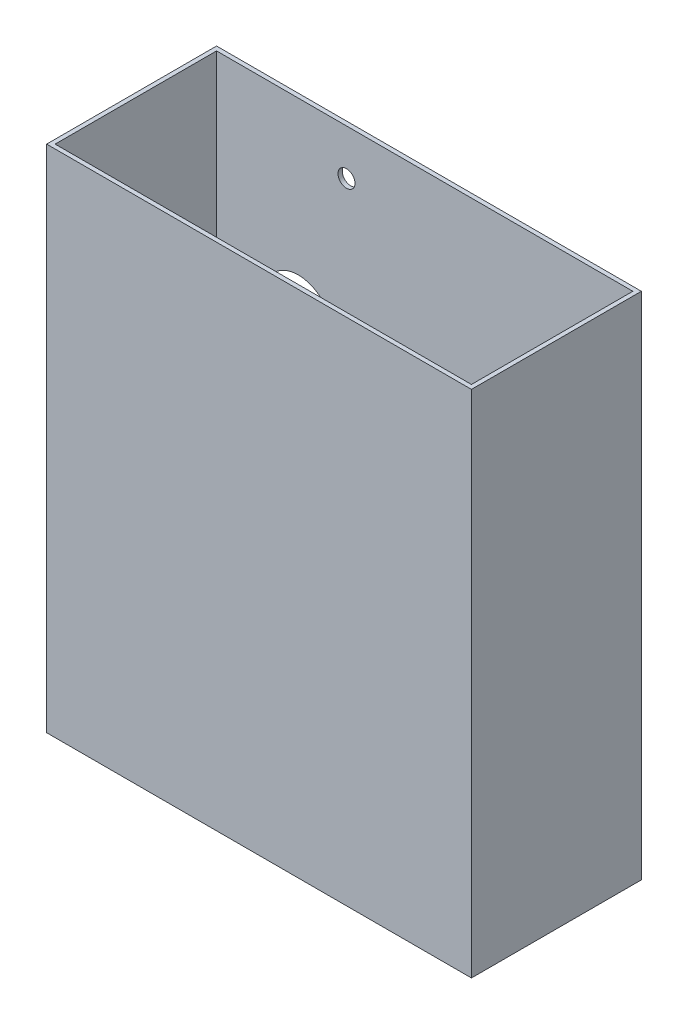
ISO-10303-21;
HEADER;
FILE_DESCRIPTION(('STEP AP214'),'2;1');
FILE_NAME('part.step','',(''),(''),'','','');
FILE_SCHEMA(('AUTOMOTIVE_DESIGN { 1 0 10303 214 1 1 1 1 }'));
ENDSEC;
DATA;
#1=APPLICATION_CONTEXT('core data for automotive mechanical design processes');
#2=APPLICATION_PROTOCOL_DEFINITION('international standard','automotive_design',2000,#1);
#3=PRODUCT_CONTEXT('',#1,'mechanical');
#4=PRODUCT('Part','Part','',(#3));
#5=PRODUCT_RELATED_PRODUCT_CATEGORY('part','',(#4));
#6=PRODUCT_DEFINITION_FORMATION('','',#4);
#7=PRODUCT_DEFINITION_CONTEXT('part definition',#1,'design');
#8=PRODUCT_DEFINITION('design','',#6,#7);
#9=PRODUCT_DEFINITION_SHAPE('','',#8);
#10=(LENGTH_UNIT() NAMED_UNIT(*) SI_UNIT(.MILLI.,.METRE.));
#11=(NAMED_UNIT(*) PLANE_ANGLE_UNIT() SI_UNIT($,.RADIAN.));
#12=(NAMED_UNIT(*) SI_UNIT($,.STERADIAN.) SOLID_ANGLE_UNIT());
#13=UNCERTAINTY_MEASURE_WITH_UNIT(LENGTH_MEASURE(1.E-05),#10,'distance_accuracy_value','');
#14=(GEOMETRIC_REPRESENTATION_CONTEXT(3) GLOBAL_UNCERTAINTY_ASSIGNED_CONTEXT((#13)) GLOBAL_UNIT_ASSIGNED_CONTEXT((#10,
#11,#12)) REPRESENTATION_CONTEXT('',''));
#15=CARTESIAN_POINT('',(0.,0.,0.));
#16=DIRECTION('',(0.,0.,1.));
#17=DIRECTION('',(1.,0.,0.));
#18=AXIS2_PLACEMENT_3D('',#15,#16,#17);
#19=CARTESIAN_POINT('',(63.5,152.4,-25.4));
#20=DIRECTION('',(-1.,0.,0.));
#21=DIRECTION('',(0.,0.,1.));
#22=AXIS2_PLACEMENT_3D('',#19,#20,#21);
#23=PLANE('',#22);
#24=DIRECTION('',(0.,0.,-1.));
#25=VECTOR('',#24,1.);
#26=CARTESIAN_POINT('',(63.5,0.,-25.4));
#27=LINE('',#26,#25);
#28=CARTESIAN_POINT('',(63.5,0.,25.4));
#29=VERTEX_POINT('',#28);
#30=CARTESIAN_POINT('',(63.5,0.,-25.4));
#31=VERTEX_POINT('',#30);
#32=EDGE_CURVE('E167',#29,#31,#27,.T.);
#33=ORIENTED_EDGE('',*,*,#32,.T.);
#34=DIRECTION('',(0.,-1.,0.));
#35=VECTOR('',#34,1.);
#36=CARTESIAN_POINT('',(63.5,152.4,-25.4));
#37=LINE('',#36,#35);
#38=CARTESIAN_POINT('',(63.5,152.4,-25.4));
#39=VERTEX_POINT('',#38);
#40=EDGE_CURVE('E11',#39,#31,#37,.T.);
#41=ORIENTED_EDGE('',*,*,#40,.F.);
#42=DIRECTION('',(0.,0.,-1.));
#43=VECTOR('',#42,1.);
#44=CARTESIAN_POINT('',(63.5,152.4,-25.4));
#45=LINE('',#44,#43);
#46=CARTESIAN_POINT('',(63.5,152.4,25.4));
#47=VERTEX_POINT('',#46);
#48=EDGE_CURVE('E173',#47,#39,#45,.T.);
#49=ORIENTED_EDGE('',*,*,#48,.F.);
#50=DIRECTION('',(0.,-1.,0.));
#51=VECTOR('',#50,1.);
#52=CARTESIAN_POINT('',(63.5,152.4,25.4));
#53=LINE('',#52,#51);
#54=EDGE_CURVE('E183',#47,#29,#53,.T.);
#55=ORIENTED_EDGE('',*,*,#54,.T.);
#56=EDGE_LOOP('',(#33,#41,#49,#55));
#57=FACE_BOUND('',#56,.T.);
#58=ADVANCED_FACE('F43',(#57),#23,.F.);
#59=CARTESIAN_POINT('',(-63.5,152.4,-25.4));
#60=DIRECTION('',(0.,0.,1.));
#61=DIRECTION('',(1.,0.,0.));
#62=AXIS2_PLACEMENT_3D('',#59,#60,#61);
#63=PLANE('',#62);
#64=CARTESIAN_POINT('',(-23.3777680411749,138.793670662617,-25.4));
#65=DIRECTION('',(0.,0.,-1.));
#66=DIRECTION('',(-1.,0.,0.));
#67=AXIS2_PLACEMENT_3D('',#64,#65,#66);
#68=CIRCLE('',#67,2.54);
#69=CARTESIAN_POINT('',(-25.9177680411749,138.793670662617,-25.4));
#70=VERTEX_POINT('',#69);
#71=EDGE_CURVE('E414',#70,#70,#68,.T.);
#72=ORIENTED_EDGE('',*,*,#71,.F.);
#73=EDGE_LOOP('',(#72));
#74=FACE_BOUND('',#73,.T.);
#75=CARTESIAN_POINT('',(-37.7685637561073,20.3620376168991,-25.4));
#76=DIRECTION('',(0.,0.,-1.));
#77=DIRECTION('',(-1.,0.,0.));
#78=AXIS2_PLACEMENT_3D('',#75,#76,#77);
#79=CIRCLE('',#78,11.176);
#80=CARTESIAN_POINT('',(-48.9445637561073,20.3620376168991,-25.4));
#81=VERTEX_POINT('',#80);
#82=EDGE_CURVE('E408',#81,#81,#79,.T.);
#83=ORIENTED_EDGE('',*,*,#82,.F.);
#84=EDGE_LOOP('',(#83));
#85=FACE_BOUND('',#84,.T.);
#86=CARTESIAN_POINT('',(-37.8026325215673,96.4620301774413,-25.4));
#87=DIRECTION('',(0.,0.,-1.));
#88=DIRECTION('',(-1.,0.,0.));
#89=AXIS2_PLACEMENT_3D('',#86,#87,#88);
#90=CIRCLE('',#89,10.16);
#91=CARTESIAN_POINT('',(-47.9626325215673,96.4620301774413,-25.4));
#92=VERTEX_POINT('',#91);
#93=EDGE_CURVE('E400',#92,#92,#90,.T.);
#94=ORIENTED_EDGE('',*,*,#93,.F.);
#95=EDGE_LOOP('',(#94));
#96=FACE_BOUND('',#95,.T.);
#97=CARTESIAN_POINT('',(-37.7685637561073,58.6349226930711,-25.4));
#98=DIRECTION('',(0.,0.,-1.));
#99=DIRECTION('',(-1.,0.,0.));
#100=AXIS2_PLACEMENT_3D('',#97,#98,#99);
#101=CIRCLE('',#100,10.16);
#102=CARTESIAN_POINT('',(-47.9285637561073,58.6349226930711,-25.4));
#103=VERTEX_POINT('',#102);
#104=EDGE_CURVE('E149',#103,#103,#101,.T.);
#105=ORIENTED_EDGE('',*,*,#104,.F.);
#106=EDGE_LOOP('',(#105));
#107=FACE_BOUND('',#106,.T.);
#108=DIRECTION('',(-1.,0.,0.));
#109=VECTOR('',#108,1.);
#110=CARTESIAN_POINT('',(-63.5,0.,-25.4));
#111=LINE('',#110,#109);
#112=CARTESIAN_POINT('',(-63.5,0.,-25.4));
#113=VERTEX_POINT('',#112);
#114=EDGE_CURVE('E187',#31,#113,#111,.T.);
#115=ORIENTED_EDGE('',*,*,#114,.T.);
#116=DIRECTION('',(0.,-1.,0.));
#117=VECTOR('',#116,1.);
#118=CARTESIAN_POINT('',(-63.5,152.4,-25.4));
#119=LINE('',#118,#117);
#120=CARTESIAN_POINT('',(-63.5,152.4,-25.4));
#121=VERTEX_POINT('',#120);
#122=EDGE_CURVE('E52',#121,#113,#119,.T.);
#123=ORIENTED_EDGE('',*,*,#122,.F.);
#124=DIRECTION('',(-1.,0.,0.));
#125=VECTOR('',#124,1.);
#126=CARTESIAN_POINT('',(-63.5,152.4,-25.4));
#127=LINE('',#126,#125);
#128=EDGE_CURVE('E97',#39,#121,#127,.T.);
#129=ORIENTED_EDGE('',*,*,#128,.F.);
#130=ORIENTED_EDGE('',*,*,#40,.T.);
#131=EDGE_LOOP('',(#115,#123,#129,#130));
#132=FACE_BOUND('',#131,.T.);
#133=ADVANCED_FACE('F234',(#74,#85,#96,#107,#132),#63,.F.);
#134=CARTESIAN_POINT('',(-63.5,152.4,-25.4));
#135=DIRECTION('',(1.,0.,0.));
#136=DIRECTION('',(0.,0.,-1.));
#137=AXIS2_PLACEMENT_3D('',#134,#135,#136);
#138=PLANE('',#137);
#139=DIRECTION('',(0.,0.,1.));
#140=VECTOR('',#139,1.);
#141=CARTESIAN_POINT('',(-63.5,0.,-25.4));
#142=LINE('',#141,#140);
#143=CARTESIAN_POINT('',(-63.5,0.,25.4));
#144=VERTEX_POINT('',#143);
#145=EDGE_CURVE('E190',#113,#144,#142,.T.);
#146=ORIENTED_EDGE('',*,*,#145,.T.);
#147=DIRECTION('',(0.,-1.,0.));
#148=VECTOR('',#147,1.);
#149=CARTESIAN_POINT('',(-63.5,152.4,25.4));
#150=LINE('',#149,#148);
#151=CARTESIAN_POINT('',(-63.5,152.4,25.4));
#152=VERTEX_POINT('',#151);
#153=EDGE_CURVE('E197',#152,#144,#150,.T.);
#154=ORIENTED_EDGE('',*,*,#153,.F.);
#155=DIRECTION('',(0.,0.,1.));
#156=VECTOR('',#155,1.);
#157=CARTESIAN_POINT('',(-63.5,152.4,-25.4));
#158=LINE('',#157,#156);
#159=EDGE_CURVE('E178',#121,#152,#158,.T.);
#160=ORIENTED_EDGE('',*,*,#159,.F.);
#161=ORIENTED_EDGE('',*,*,#122,.T.);
#162=EDGE_LOOP('',(#146,#154,#160,#161));
#163=FACE_BOUND('',#162,.T.);
#164=ADVANCED_FACE('F239',(#163),#138,.F.);
#165=CARTESIAN_POINT('',(-63.5,152.4,25.4));
#166=DIRECTION('',(0.,0.,-1.));
#167=DIRECTION('',(-1.,0.,0.));
#168=AXIS2_PLACEMENT_3D('',#165,#166,#167);
#169=PLANE('',#168);
#170=DIRECTION('',(1.,0.,0.));
#171=VECTOR('',#170,1.);
#172=CARTESIAN_POINT('',(-63.5,0.,25.4));
#173=LINE('',#172,#171);
#174=EDGE_CURVE('E90',#144,#29,#173,.T.);
#175=ORIENTED_EDGE('',*,*,#174,.T.);
#176=ORIENTED_EDGE('',*,*,#54,.F.);
#177=DIRECTION('',(1.,0.,0.));
#178=VECTOR('',#177,1.);
#179=CARTESIAN_POINT('',(-63.5,152.4,25.4));
#180=LINE('',#179,#178);
#181=EDGE_CURVE('E69',#152,#47,#180,.T.);
#182=ORIENTED_EDGE('',*,*,#181,.F.);
#183=ORIENTED_EDGE('',*,*,#153,.T.);
#184=EDGE_LOOP('',(#175,#176,#182,#183));
#185=FACE_BOUND('',#184,.T.);
#186=ADVANCED_FACE('F252',(#185),#169,.F.);
#187=CARTESIAN_POINT('',(0.,152.4,0.));
#188=DIRECTION('',(0.,1.,0.));
#189=DIRECTION('',(0.,0.,1.));
#190=AXIS2_PLACEMENT_3D('',#187,#188,#189);
#191=PLANE('',#190);
#192=DIRECTION('',(0.,0.,-1.));
#193=VECTOR('',#192,1.);
#194=CARTESIAN_POINT('',(62.23,152.4,-24.13));
#195=LINE('',#194,#193);
#196=CARTESIAN_POINT('',(62.23,152.4,24.13));
#197=VERTEX_POINT('',#196);
#198=CARTESIAN_POINT('',(62.23,152.4,-24.13));
#199=VERTEX_POINT('',#198);
#200=EDGE_CURVE('E60',#197,#199,#195,.T.);
#201=ORIENTED_EDGE('',*,*,#200,.F.);
#202=DIRECTION('',(1.,0.,0.));
#203=VECTOR('',#202,1.);
#204=CARTESIAN_POINT('',(-62.23,152.4,24.13));
#205=LINE('',#204,#203);
#206=CARTESIAN_POINT('',(-62.23,152.4,24.13));
#207=VERTEX_POINT('',#206);
#208=EDGE_CURVE('E142',#207,#197,#205,.T.);
#209=ORIENTED_EDGE('',*,*,#208,.F.);
#210=DIRECTION('',(0.,0.,1.));
#211=VECTOR('',#210,1.);
#212=CARTESIAN_POINT('',(-62.23,152.4,-24.13));
#213=LINE('',#212,#211);
#214=CARTESIAN_POINT('',(-62.23,152.4,-24.13));
#215=VERTEX_POINT('',#214);
#216=EDGE_CURVE('E146',#215,#207,#213,.T.);
#217=ORIENTED_EDGE('',*,*,#216,.F.);
#218=DIRECTION('',(-1.,0.,0.));
#219=VECTOR('',#218,1.);
#220=CARTESIAN_POINT('',(-62.23,152.4,-24.13));
#221=LINE('',#220,#219);
#222=EDGE_CURVE('E158',#199,#215,#221,.T.);
#223=ORIENTED_EDGE('',*,*,#222,.F.);
#224=EDGE_LOOP('',(#201,#209,#217,#223));
#225=FACE_BOUND('',#224,.T.);
#226=ORIENTED_EDGE('',*,*,#48,.T.);
#227=ORIENTED_EDGE('',*,*,#128,.T.);
#228=ORIENTED_EDGE('',*,*,#159,.T.);
#229=ORIENTED_EDGE('',*,*,#181,.T.);
#230=EDGE_LOOP('',(#226,#227,#228,#229));
#231=FACE_BOUND('',#230,.T.);
#232=ADVANCED_FACE('F250',(#225,#231),#191,.T.);
#233=CARTESIAN_POINT('',(0.,0.,0.));
#234=DIRECTION('',(0.,1.,0.));
#235=DIRECTION('',(0.,0.,1.));
#236=AXIS2_PLACEMENT_3D('',#233,#234,#235);
#237=PLANE('',#236);
#238=ORIENTED_EDGE('',*,*,#32,.F.);
#239=ORIENTED_EDGE('',*,*,#174,.F.);
#240=ORIENTED_EDGE('',*,*,#145,.F.);
#241=ORIENTED_EDGE('',*,*,#114,.F.);
#242=EDGE_LOOP('',(#238,#239,#240,#241));
#243=FACE_BOUND('',#242,.T.);
#244=ADVANCED_FACE('F245',(#243),#237,.F.);
#245=CARTESIAN_POINT('',(62.23,2.54000000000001,-24.13));
#246=DIRECTION('',(1.,0.,0.));
#247=DIRECTION('',(0.,0.,-1.));
#248=AXIS2_PLACEMENT_3D('',#245,#246,#247);
#249=PLANE('',#248);
#250=ORIENTED_EDGE('',*,*,#200,.T.);
#251=DIRECTION('',(0.,1.,0.));
#252=VECTOR('',#251,1.);
#253=CARTESIAN_POINT('',(62.23,2.54000000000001,-24.13));
#254=LINE('',#253,#252);
#255=CARTESIAN_POINT('',(62.23,2.54000000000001,-24.13));
#256=VERTEX_POINT('',#255);
#257=EDGE_CURVE('E117',#256,#199,#254,.T.);
#258=ORIENTED_EDGE('',*,*,#257,.F.);
#259=DIRECTION('',(0.,0.,-1.));
#260=VECTOR('',#259,1.);
#261=CARTESIAN_POINT('',(62.23,2.54000000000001,-24.13));
#262=LINE('',#261,#260);
#263=CARTESIAN_POINT('',(62.23,2.54000000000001,24.13));
#264=VERTEX_POINT('',#263);
#265=EDGE_CURVE('E121',#264,#256,#262,.T.);
#266=ORIENTED_EDGE('',*,*,#265,.F.);
#267=DIRECTION('',(0.,1.,0.));
#268=VECTOR('',#267,1.);
#269=CARTESIAN_POINT('',(62.23,2.54000000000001,24.13));
#270=LINE('',#269,#268);
#271=EDGE_CURVE('E164',#264,#197,#270,.T.);
#272=ORIENTED_EDGE('',*,*,#271,.T.);
#273=EDGE_LOOP('',(#250,#258,#266,#272));
#274=FACE_BOUND('',#273,.T.);
#275=ADVANCED_FACE('F119',(#274),#249,.F.);
#276=CARTESIAN_POINT('',(-62.23,2.54000000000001,24.13));
#277=DIRECTION('',(0.,0.,1.));
#278=DIRECTION('',(1.,0.,0.));
#279=AXIS2_PLACEMENT_3D('',#276,#277,#278);
#280=PLANE('',#279);
#281=ORIENTED_EDGE('',*,*,#208,.T.);
#282=ORIENTED_EDGE('',*,*,#271,.F.);
#283=DIRECTION('',(1.,0.,0.));
#284=VECTOR('',#283,1.);
#285=CARTESIAN_POINT('',(-62.23,2.54000000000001,24.13));
#286=LINE('',#285,#284);
#287=CARTESIAN_POINT('',(-62.23,2.54000000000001,24.13));
#288=VERTEX_POINT('',#287);
#289=EDGE_CURVE('E128',#288,#264,#286,.T.);
#290=ORIENTED_EDGE('',*,*,#289,.F.);
#291=DIRECTION('',(0.,1.,0.));
#292=VECTOR('',#291,1.);
#293=CARTESIAN_POINT('',(-62.23,2.54000000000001,24.13));
#294=LINE('',#293,#292);
#295=EDGE_CURVE('E168',#288,#207,#294,.T.);
#296=ORIENTED_EDGE('',*,*,#295,.T.);
#297=EDGE_LOOP('',(#281,#282,#290,#296));
#298=FACE_BOUND('',#297,.T.);
#299=ADVANCED_FACE('F295',(#298),#280,.F.);
#300=CARTESIAN_POINT('',(-62.23,2.54000000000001,-24.13));
#301=DIRECTION('',(-1.,0.,0.));
#302=DIRECTION('',(0.,0.,1.));
#303=AXIS2_PLACEMENT_3D('',#300,#301,#302);
#304=PLANE('',#303);
#305=ORIENTED_EDGE('',*,*,#216,.T.);
#306=ORIENTED_EDGE('',*,*,#295,.F.);
#307=DIRECTION('',(0.,0.,1.));
#308=VECTOR('',#307,1.);
#309=CARTESIAN_POINT('',(-62.23,2.54000000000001,-24.13));
#310=LINE('',#309,#308);
#311=CARTESIAN_POINT('',(-62.23,2.54000000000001,-24.13));
#312=VERTEX_POINT('',#311);
#313=EDGE_CURVE('E137',#312,#288,#310,.T.);
#314=ORIENTED_EDGE('',*,*,#313,.F.);
#315=DIRECTION('',(0.,1.,0.));
#316=VECTOR('',#315,1.);
#317=CARTESIAN_POINT('',(-62.23,2.54000000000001,-24.13));
#318=LINE('',#317,#316);
#319=EDGE_CURVE('E127',#312,#215,#318,.T.);
#320=ORIENTED_EDGE('',*,*,#319,.T.);
#321=EDGE_LOOP('',(#305,#306,#314,#320));
#322=FACE_BOUND('',#321,.T.);
#323=ADVANCED_FACE('F304',(#322),#304,.F.);
#324=CARTESIAN_POINT('',(-62.23,2.54000000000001,-24.13));
#325=DIRECTION('',(0.,0.,-1.));
#326=DIRECTION('',(-1.,0.,0.));
#327=AXIS2_PLACEMENT_3D('',#324,#325,#326);
#328=PLANE('',#327);
#329=CARTESIAN_POINT('',(-23.3777680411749,138.793670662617,-24.13));
#330=DIRECTION('',(0.,0.,-1.));
#331=DIRECTION('',(-1.,0.,0.));
#332=AXIS2_PLACEMENT_3D('',#329,#330,#331);
#333=CIRCLE('',#332,2.54);
#334=CARTESIAN_POINT('',(-25.9177680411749,138.793670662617,-24.13));
#335=VERTEX_POINT('',#334);
#336=EDGE_CURVE('E46',#335,#335,#333,.T.);
#337=ORIENTED_EDGE('',*,*,#336,.T.);
#338=EDGE_LOOP('',(#337));
#339=FACE_BOUND('',#338,.T.);
#340=CARTESIAN_POINT('',(-37.7685637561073,20.3620376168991,-24.13));
#341=DIRECTION('',(0.,0.,-1.));
#342=DIRECTION('',(-1.,0.,0.));
#343=AXIS2_PLACEMENT_3D('',#340,#341,#342);
#344=CIRCLE('',#343,11.176);
#345=CARTESIAN_POINT('',(-48.9445637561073,20.3620376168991,-24.13));
#346=VERTEX_POINT('',#345);
#347=EDGE_CURVE('E210',#346,#346,#344,.T.);
#348=ORIENTED_EDGE('',*,*,#347,.T.);
#349=EDGE_LOOP('',(#348));
#350=FACE_BOUND('',#349,.T.);
#351=CARTESIAN_POINT('',(-37.8026325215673,96.4620301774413,-24.13));
#352=DIRECTION('',(0.,0.,-1.));
#353=DIRECTION('',(-1.,0.,0.));
#354=AXIS2_PLACEMENT_3D('',#351,#352,#353);
#355=CIRCLE('',#354,10.16);
#356=CARTESIAN_POINT('',(-47.9626325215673,96.4620301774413,-24.13));
#357=VERTEX_POINT('',#356);
#358=EDGE_CURVE('E207',#357,#357,#355,.T.);
#359=ORIENTED_EDGE('',*,*,#358,.T.);
#360=EDGE_LOOP('',(#359));
#361=FACE_BOUND('',#360,.T.);
#362=CARTESIAN_POINT('',(-37.7685637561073,58.6349226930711,-24.13));
#363=DIRECTION('',(0.,0.,-1.));
#364=DIRECTION('',(-1.,0.,0.));
#365=AXIS2_PLACEMENT_3D('',#362,#363,#364);
#366=CIRCLE('',#365,10.16);
#367=CARTESIAN_POINT('',(-47.9285637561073,58.6349226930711,-24.13));
#368=VERTEX_POINT('',#367);
#369=EDGE_CURVE('E203',#368,#368,#366,.T.);
#370=ORIENTED_EDGE('',*,*,#369,.T.);
#371=EDGE_LOOP('',(#370));
#372=FACE_BOUND('',#371,.T.);
#373=ORIENTED_EDGE('',*,*,#222,.T.);
#374=ORIENTED_EDGE('',*,*,#319,.F.);
#375=DIRECTION('',(-1.,0.,0.));
#376=VECTOR('',#375,1.);
#377=CARTESIAN_POINT('',(-62.23,2.54000000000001,-24.13));
#378=LINE('',#377,#376);
#379=EDGE_CURVE('E131',#256,#312,#378,.T.);
#380=ORIENTED_EDGE('',*,*,#379,.F.);
#381=ORIENTED_EDGE('',*,*,#257,.T.);
#382=EDGE_LOOP('',(#373,#374,#380,#381));
#383=FACE_BOUND('',#382,.T.);
#384=ADVANCED_FACE('F132',(#339,#350,#361,#372,#383),#328,.F.);
#385=CARTESIAN_POINT('',(0.,2.54000000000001,0.));
#386=DIRECTION('',(0.,1.,0.));
#387=DIRECTION('',(0.,0.,1.));
#388=AXIS2_PLACEMENT_3D('',#385,#386,#387);
#389=PLANE('',#388);
#390=ORIENTED_EDGE('',*,*,#265,.T.);
#391=ORIENTED_EDGE('',*,*,#379,.T.);
#392=ORIENTED_EDGE('',*,*,#313,.T.);
#393=ORIENTED_EDGE('',*,*,#289,.T.);
#394=EDGE_LOOP('',(#390,#391,#392,#393));
#395=FACE_BOUND('',#394,.T.);
#396=ADVANCED_FACE('F139',(#395),#389,.T.);
#397=CARTESIAN_POINT('',(-37.7685637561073,58.6349226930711,-22.86));
#398=DIRECTION('',(0.,0.,-1.));
#399=DIRECTION('',(-1.,0.,0.));
#400=AXIS2_PLACEMENT_3D('',#397,#398,#399);
#401=CYLINDRICAL_SURFACE('',#400,10.16);
#402=ORIENTED_EDGE('',*,*,#104,.T.);
#403=EDGE_LOOP('',(#402));
#404=FACE_BOUND('',#403,.T.);
#405=ORIENTED_EDGE('',*,*,#369,.F.);
#406=EDGE_LOOP('',(#405));
#407=FACE_BOUND('',#406,.T.);
#408=ADVANCED_FACE('F326',(#404,#407),#401,.F.);
#409=CARTESIAN_POINT('',(-37.8026325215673,96.4620301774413,-22.86));
#410=DIRECTION('',(0.,0.,-1.));
#411=DIRECTION('',(-1.,0.,0.));
#412=AXIS2_PLACEMENT_3D('',#409,#410,#411);
#413=CYLINDRICAL_SURFACE('',#412,10.16);
#414=ORIENTED_EDGE('',*,*,#93,.T.);
#415=EDGE_LOOP('',(#414));
#416=FACE_BOUND('',#415,.T.);
#417=ORIENTED_EDGE('',*,*,#358,.F.);
#418=EDGE_LOOP('',(#417));
#419=FACE_BOUND('',#418,.T.);
#420=ADVANCED_FACE('F228',(#416,#419),#413,.F.);
#421=CARTESIAN_POINT('',(-37.7685637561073,20.3620376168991,-22.86));
#422=DIRECTION('',(0.,0.,-1.));
#423=DIRECTION('',(-1.,0.,0.));
#424=AXIS2_PLACEMENT_3D('',#421,#422,#423);
#425=CYLINDRICAL_SURFACE('',#424,11.176);
#426=ORIENTED_EDGE('',*,*,#82,.T.);
#427=EDGE_LOOP('',(#426));
#428=FACE_BOUND('',#427,.T.);
#429=ORIENTED_EDGE('',*,*,#347,.F.);
#430=EDGE_LOOP('',(#429));
#431=FACE_BOUND('',#430,.T.);
#432=ADVANCED_FACE('F222',(#428,#431),#425,.F.);
#433=CARTESIAN_POINT('',(-23.3777680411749,138.793670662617,-22.86));
#434=DIRECTION('',(0.,0.,-1.));
#435=DIRECTION('',(-1.,0.,0.));
#436=AXIS2_PLACEMENT_3D('',#433,#434,#435);
#437=CYLINDRICAL_SURFACE('',#436,2.54);
#438=ORIENTED_EDGE('',*,*,#71,.T.);
#439=EDGE_LOOP('',(#438));
#440=FACE_BOUND('',#439,.T.);
#441=ORIENTED_EDGE('',*,*,#336,.F.);
#442=EDGE_LOOP('',(#441));
#443=FACE_BOUND('',#442,.T.);
#444=ADVANCED_FACE('F220',(#440,#443),#437,.F.);
#445=CLOSED_SHELL('',(#58,#133,#164,#186,#232,#244,#275,#299,#323,#384,#396,#408,#420,#432,#444));
#446=MANIFOLD_SOLID_BREP('B2',#445);
#447=ADVANCED_BREP_SHAPE_REPRESENTATION('',(#18,#446),#14);
#448=SHAPE_DEFINITION_REPRESENTATION(#9,#447);
ENDSEC;
END-ISO-10303-21;
